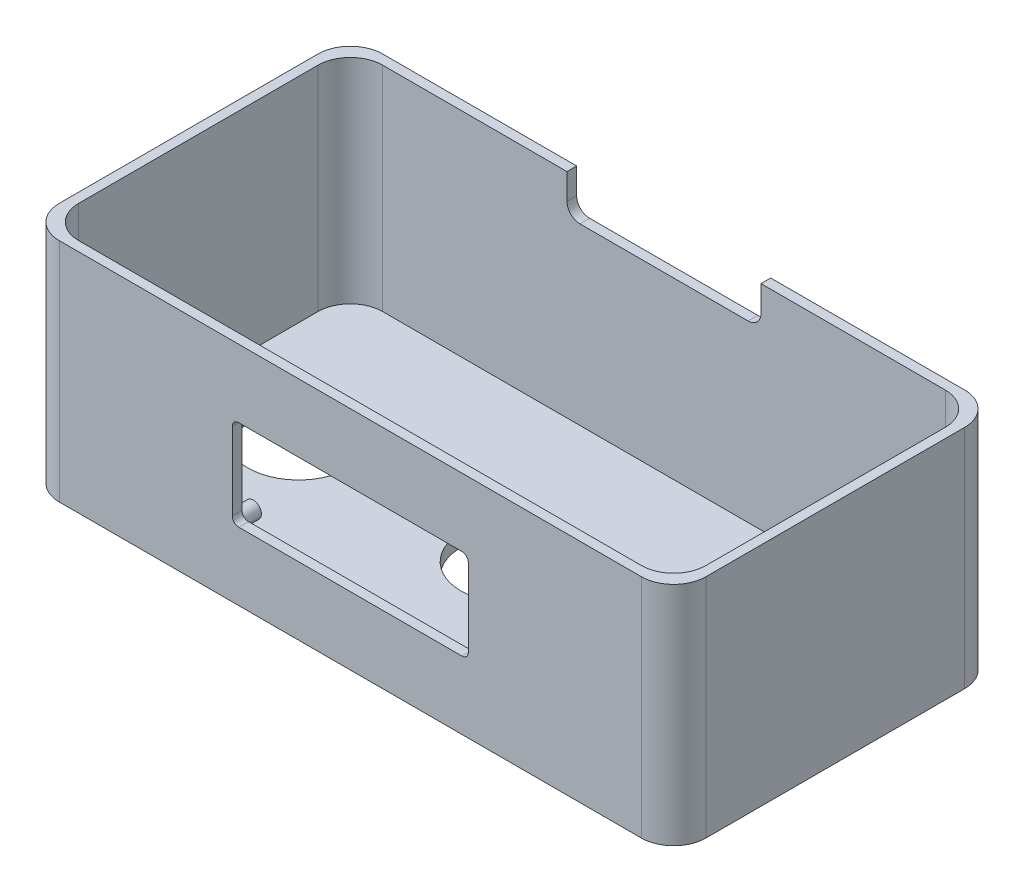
ISO-10303-21;
HEADER;
FILE_DESCRIPTION(('STEP AP214'),'2;1');
FILE_NAME('part.step','',(''),(''),'','','');
FILE_SCHEMA(('AUTOMOTIVE_DESIGN { 1 0 10303 214 1 1 1 1 }'));
ENDSEC;
DATA;
#1=APPLICATION_CONTEXT('core data for automotive mechanical design processes');
#2=APPLICATION_PROTOCOL_DEFINITION('international standard','automotive_design',2000,#1);
#3=PRODUCT_CONTEXT('',#1,'mechanical');
#4=PRODUCT('Part','Part','',(#3));
#5=PRODUCT_RELATED_PRODUCT_CATEGORY('part','',(#4));
#6=PRODUCT_DEFINITION_FORMATION('','',#4);
#7=PRODUCT_DEFINITION_CONTEXT('part definition',#1,'design');
#8=PRODUCT_DEFINITION('design','',#6,#7);
#9=PRODUCT_DEFINITION_SHAPE('','',#8);
#10=(LENGTH_UNIT() NAMED_UNIT(*) SI_UNIT(.MILLI.,.METRE.));
#11=(NAMED_UNIT(*) PLANE_ANGLE_UNIT() SI_UNIT($,.RADIAN.));
#12=(NAMED_UNIT(*) SI_UNIT($,.STERADIAN.) SOLID_ANGLE_UNIT());
#13=UNCERTAINTY_MEASURE_WITH_UNIT(LENGTH_MEASURE(1.E-05),#10,'distance_accuracy_value','');
#14=(GEOMETRIC_REPRESENTATION_CONTEXT(3) GLOBAL_UNCERTAINTY_ASSIGNED_CONTEXT((#13)) GLOBAL_UNIT_ASSIGNED_CONTEXT((#10,
#11,#12)) REPRESENTATION_CONTEXT('',''));
#15=CARTESIAN_POINT('',(0.,0.,0.));
#16=DIRECTION('',(0.,0.,1.));
#17=DIRECTION('',(1.,0.,0.));
#18=AXIS2_PLACEMENT_3D('',#15,#16,#17);
#19=CARTESIAN_POINT('',(100.,70.,50.));
#20=DIRECTION('',(0.,-1.,0.));
#21=DIRECTION('',(0.,0.,-1.));
#22=AXIS2_PLACEMENT_3D('',#19,#20,#21);
#23=CYLINDRICAL_SURFACE('',#22,15.7221428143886);
#24=CARTESIAN_POINT('',(100.,0.,50.));
#25=DIRECTION('',(0.,1.,0.));
#26=DIRECTION('',(0.,0.,1.));
#27=AXIS2_PLACEMENT_3D('',#24,#25,#26);
#28=CIRCLE('',#27,15.7221428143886);
#29=CARTESIAN_POINT('',(100.,0.,65.7221428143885));
#30=VERTEX_POINT('',#29);
#31=EDGE_CURVE('E446',#30,#30,#28,.T.);
#32=ORIENTED_EDGE('',*,*,#31,.F.);
#33=EDGE_LOOP('',(#32));
#34=FACE_BOUND('',#33,.T.);
#35=CARTESIAN_POINT('',(100.,4.,50.));
#36=DIRECTION('',(0.,1.,0.));
#37=DIRECTION('',(0.,0.,1.));
#38=AXIS2_PLACEMENT_3D('',#35,#36,#37);
#39=CIRCLE('',#38,15.7221428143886);
#40=CARTESIAN_POINT('',(100.,4.,65.7221428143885));
#41=VERTEX_POINT('',#40);
#42=EDGE_CURVE('E434',#41,#41,#39,.T.);
#43=ORIENTED_EDGE('',*,*,#42,.T.);
#44=EDGE_LOOP('',(#43));
#45=FACE_BOUND('',#44,.T.);
#46=ADVANCED_FACE('F39',(#34,#45),#23,.F.);
#47=CARTESIAN_POINT('',(166.,70.,50.));
#48=DIRECTION('',(0.,-1.,0.));
#49=DIRECTION('',(0.,0.,-1.));
#50=AXIS2_PLACEMENT_3D('',#47,#48,#49);
#51=CYLINDRICAL_SURFACE('',#50,15.7221428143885);
#52=CARTESIAN_POINT('',(166.,0.,50.));
#53=DIRECTION('',(0.,1.,0.));
#54=DIRECTION('',(0.,0.,1.));
#55=AXIS2_PLACEMENT_3D('',#52,#53,#54);
#56=CIRCLE('',#55,15.7221428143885);
#57=CARTESIAN_POINT('',(166.,0.,65.7221428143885));
#58=VERTEX_POINT('',#57);
#59=EDGE_CURVE('E442',#58,#58,#56,.T.);
#60=ORIENTED_EDGE('',*,*,#59,.F.);
#61=EDGE_LOOP('',(#60));
#62=FACE_BOUND('',#61,.T.);
#63=CARTESIAN_POINT('',(166.,4.,50.));
#64=DIRECTION('',(0.,1.,0.));
#65=DIRECTION('',(0.,0.,1.));
#66=AXIS2_PLACEMENT_3D('',#63,#64,#65);
#67=CIRCLE('',#66,15.7221428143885);
#68=CARTESIAN_POINT('',(166.,4.,65.7221428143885));
#69=VERTEX_POINT('',#68);
#70=EDGE_CURVE('E430',#69,#69,#67,.T.);
#71=ORIENTED_EDGE('',*,*,#70,.T.);
#72=EDGE_LOOP('',(#71));
#73=FACE_BOUND('',#72,.T.);
#74=ADVANCED_FACE('F698',(#62,#73),#51,.F.);
#75=CARTESIAN_POINT('',(34.,70.,50.0000000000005));
#76=DIRECTION('',(0.,-1.,0.));
#77=DIRECTION('',(0.,0.,-1.));
#78=AXIS2_PLACEMENT_3D('',#75,#76,#77);
#79=CYLINDRICAL_SURFACE('',#78,15.7221428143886);
#80=CARTESIAN_POINT('',(34.,0.,50.0000000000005));
#81=DIRECTION('',(0.,1.,0.));
#82=DIRECTION('',(0.,0.,1.));
#83=AXIS2_PLACEMENT_3D('',#80,#81,#82);
#84=CIRCLE('',#83,15.7221428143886);
#85=CARTESIAN_POINT('',(34.,0.,65.722142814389));
#86=VERTEX_POINT('',#85);
#87=EDGE_CURVE('E438',#86,#86,#84,.T.);
#88=ORIENTED_EDGE('',*,*,#87,.F.);
#89=EDGE_LOOP('',(#88));
#90=FACE_BOUND('',#89,.T.);
#91=CARTESIAN_POINT('',(34.,4.,50.0000000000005));
#92=DIRECTION('',(0.,1.,0.));
#93=DIRECTION('',(0.,0.,1.));
#94=AXIS2_PLACEMENT_3D('',#91,#92,#93);
#95=CIRCLE('',#94,15.7221428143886);
#96=CARTESIAN_POINT('',(34.,4.,65.722142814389));
#97=VERTEX_POINT('',#96);
#98=EDGE_CURVE('E407',#97,#97,#95,.T.);
#99=ORIENTED_EDGE('',*,*,#98,.T.);
#100=EDGE_LOOP('',(#99));
#101=FACE_BOUND('',#100,.T.);
#102=ADVANCED_FACE('F704',(#90,#101),#79,.F.);
#103=CARTESIAN_POINT('',(10.,70.,10.));
#104=DIRECTION('',(0.,1.,0.));
#105=DIRECTION('',(0.,0.,1.));
#106=AXIS2_PLACEMENT_3D('',#103,#104,#105);
#107=PLANE('',#106);
#108=DIRECTION('',(0.,0.,-1.));
#109=VECTOR('',#108,1.);
#110=CARTESIAN_POINT('',(130.,70.,66.));
#111=LINE('',#110,#109);
#112=CARTESIAN_POINT('',(130.,70.,3.));
#113=VERTEX_POINT('',#112);
#114=CARTESIAN_POINT('',(130.,70.,0.));
#115=VERTEX_POINT('',#114);
#116=EDGE_CURVE('E321',#113,#115,#111,.T.);
#117=ORIENTED_EDGE('',*,*,#116,.F.);
#118=DIRECTION('',(-1.,0.,0.));
#119=VECTOR('',#118,1.);
#120=CARTESIAN_POINT('',(13.0000000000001,70.,3.));
#121=LINE('',#120,#119);
#122=CARTESIAN_POINT('',(187.,70.,3.));
#123=VERTEX_POINT('',#122);
#124=EDGE_CURVE('E393',#123,#113,#121,.T.);
#125=ORIENTED_EDGE('',*,*,#124,.F.);
#126=CARTESIAN_POINT('',(187.,70.,13.));
#127=DIRECTION('',(0.,1.,0.));
#128=DIRECTION('',(0.,0.,-1.));
#129=AXIS2_PLACEMENT_3D('',#126,#127,#128);
#130=CIRCLE('',#129,10.);
#131=CARTESIAN_POINT('',(197.,70.,13.0000000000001));
#132=VERTEX_POINT('',#131);
#133=EDGE_CURVE('E388',#132,#123,#130,.T.);
#134=ORIENTED_EDGE('',*,*,#133,.F.);
#135=DIRECTION('',(0.,0.,-1.));
#136=VECTOR('',#135,1.);
#137=CARTESIAN_POINT('',(197.,70.,13.0000000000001));
#138=LINE('',#137,#136);
#139=CARTESIAN_POINT('',(197.,70.,87.));
#140=VERTEX_POINT('',#139);
#141=EDGE_CURVE('E384',#140,#132,#138,.T.);
#142=ORIENTED_EDGE('',*,*,#141,.F.);
#143=CARTESIAN_POINT('',(187.,70.,87.));
#144=DIRECTION('',(0.,1.,0.));
#145=DIRECTION('',(0.,0.,1.));
#146=AXIS2_PLACEMENT_3D('',#143,#144,#145);
#147=CIRCLE('',#146,10.);
#148=CARTESIAN_POINT('',(187.,70.,97.));
#149=VERTEX_POINT('',#148);
#150=EDGE_CURVE('E380',#149,#140,#147,.T.);
#151=ORIENTED_EDGE('',*,*,#150,.F.);
#152=DIRECTION('',(1.,0.,0.));
#153=VECTOR('',#152,1.);
#154=CARTESIAN_POINT('',(13.,70.,97.));
#155=LINE('',#154,#153);
#156=CARTESIAN_POINT('',(13.,70.,97.));
#157=VERTEX_POINT('',#156);
#158=EDGE_CURVE('E376',#157,#149,#155,.T.);
#159=ORIENTED_EDGE('',*,*,#158,.F.);
#160=CARTESIAN_POINT('',(13.,70.,87.));
#161=DIRECTION('',(0.,1.,0.));
#162=DIRECTION('',(0.,0.,1.));
#163=AXIS2_PLACEMENT_3D('',#160,#161,#162);
#164=CIRCLE('',#163,9.99999999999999);
#165=CARTESIAN_POINT('',(3.00000000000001,70.,87.));
#166=VERTEX_POINT('',#165);
#167=EDGE_CURVE('E324',#166,#157,#164,.T.);
#168=ORIENTED_EDGE('',*,*,#167,.F.);
#169=DIRECTION('',(0.,0.,1.));
#170=VECTOR('',#169,1.);
#171=CARTESIAN_POINT('',(3.,70.,13.0000000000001));
#172=LINE('',#171,#170);
#173=CARTESIAN_POINT('',(3.,70.,13.0000000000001));
#174=VERTEX_POINT('',#173);
#175=EDGE_CURVE('E345',#174,#166,#172,.T.);
#176=ORIENTED_EDGE('',*,*,#175,.F.);
#177=CARTESIAN_POINT('',(13.,70.,13.));
#178=DIRECTION('',(0.,1.,0.));
#179=DIRECTION('',(0.,0.,1.));
#180=AXIS2_PLACEMENT_3D('',#177,#178,#179);
#181=CIRCLE('',#180,10.);
#182=CARTESIAN_POINT('',(13.0000000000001,70.,3.));
#183=VERTEX_POINT('',#182);
#184=EDGE_CURVE('E397',#183,#174,#181,.T.);
#185=ORIENTED_EDGE('',*,*,#184,.F.);
#186=CARTESIAN_POINT('',(70.0000000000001,70.,3.));
#187=VERTEX_POINT('',#186);
#188=EDGE_CURVE('E392',#187,#183,#121,.T.);
#189=ORIENTED_EDGE('',*,*,#188,.F.);
#190=DIRECTION('',(0.,0.,-1.));
#191=VECTOR('',#190,1.);
#192=CARTESIAN_POINT('',(70.0000000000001,70.,66.));
#193=LINE('',#192,#191);
#194=CARTESIAN_POINT('',(70.0000000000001,70.,0.));
#195=VERTEX_POINT('',#194);
#196=EDGE_CURVE('E325',#187,#195,#193,.T.);
#197=ORIENTED_EDGE('',*,*,#196,.T.);
#198=DIRECTION('',(-1.,0.,0.));
#199=VECTOR('',#198,1.);
#200=CARTESIAN_POINT('',(10.0000000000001,70.,0.));
#201=LINE('',#200,#199);
#202=CARTESIAN_POINT('',(10.0000000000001,70.,0.));
#203=VERTEX_POINT('',#202);
#204=EDGE_CURVE('E474',#195,#203,#201,.T.);
#205=ORIENTED_EDGE('',*,*,#204,.T.);
#206=CARTESIAN_POINT('',(10.,70.,10.));
#207=DIRECTION('',(0.,1.,0.));
#208=DIRECTION('',(0.,0.,1.));
#209=AXIS2_PLACEMENT_3D('',#206,#207,#208);
#210=CIRCLE('',#209,10.);
#211=CARTESIAN_POINT('',(0.,70.,10.0000000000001));
#212=VERTEX_POINT('',#211);
#213=EDGE_CURVE('E451',#203,#212,#210,.T.);
#214=ORIENTED_EDGE('',*,*,#213,.T.);
#215=DIRECTION('',(0.,0.,1.));
#216=VECTOR('',#215,1.);
#217=CARTESIAN_POINT('',(0.,70.,10.0000000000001));
#218=LINE('',#217,#216);
#219=CARTESIAN_POINT('',(0.,70.,90.0000000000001));
#220=VERTEX_POINT('',#219);
#221=EDGE_CURVE('E455',#212,#220,#218,.T.);
#222=ORIENTED_EDGE('',*,*,#221,.T.);
#223=CARTESIAN_POINT('',(10.,70.,90.0000000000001));
#224=DIRECTION('',(0.,1.,0.));
#225=DIRECTION('',(0.,0.,1.));
#226=AXIS2_PLACEMENT_3D('',#223,#224,#225);
#227=CIRCLE('',#226,9.99999999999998);
#228=CARTESIAN_POINT('',(10.,70.,100.));
#229=VERTEX_POINT('',#228);
#230=EDGE_CURVE('E459',#220,#229,#227,.T.);
#231=ORIENTED_EDGE('',*,*,#230,.T.);
#232=DIRECTION('',(1.,0.,0.));
#233=VECTOR('',#232,1.);
#234=CARTESIAN_POINT('',(10.,70.,100.));
#235=LINE('',#234,#233);
#236=CARTESIAN_POINT('',(190.,70.,100.));
#237=VERTEX_POINT('',#236);
#238=EDGE_CURVE('E462',#229,#237,#235,.T.);
#239=ORIENTED_EDGE('',*,*,#238,.T.);
#240=CARTESIAN_POINT('',(190.,70.,90.));
#241=DIRECTION('',(0.,1.,0.));
#242=DIRECTION('',(0.,0.,1.));
#243=AXIS2_PLACEMENT_3D('',#240,#241,#242);
#244=CIRCLE('',#243,10.);
#245=CARTESIAN_POINT('',(200.,70.,90.));
#246=VERTEX_POINT('',#245);
#247=EDGE_CURVE('E465',#237,#246,#244,.T.);
#248=ORIENTED_EDGE('',*,*,#247,.T.);
#249=DIRECTION('',(0.,0.,-1.));
#250=VECTOR('',#249,1.);
#251=CARTESIAN_POINT('',(200.,70.,10.0000000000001));
#252=LINE('',#251,#250);
#253=CARTESIAN_POINT('',(200.,70.,10.0000000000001));
#254=VERTEX_POINT('',#253);
#255=EDGE_CURVE('E468',#246,#254,#252,.T.);
#256=ORIENTED_EDGE('',*,*,#255,.T.);
#257=CARTESIAN_POINT('',(190.,70.,10.));
#258=DIRECTION('',(0.,1.,0.));
#259=DIRECTION('',(0.,0.,-1.));
#260=AXIS2_PLACEMENT_3D('',#257,#258,#259);
#261=CIRCLE('',#260,10.);
#262=CARTESIAN_POINT('',(190.,70.,0.));
#263=VERTEX_POINT('',#262);
#264=EDGE_CURVE('E471',#254,#263,#261,.T.);
#265=ORIENTED_EDGE('',*,*,#264,.T.);
#266=EDGE_CURVE('E475',#263,#115,#201,.T.);
#267=ORIENTED_EDGE('',*,*,#266,.T.);
#268=EDGE_LOOP('',(#117,#125,#134,#142,#151,#159,#168,#176,#185,#189,#197,#205,#214,#222,#231,
#239,#248,#256,#265,#267));
#269=FACE_BOUND('',#268,.T.);
#270=ADVANCED_FACE('F621',(#269),#107,.T.);
#271=CARTESIAN_POINT('',(10.,0.,10.));
#272=DIRECTION('',(0.,1.,0.));
#273=DIRECTION('',(0.,0.,1.));
#274=AXIS2_PLACEMENT_3D('',#271,#272,#273);
#275=PLANE('',#274);
#276=CARTESIAN_POINT('',(10.,0.,10.));
#277=DIRECTION('',(0.,1.,0.));
#278=DIRECTION('',(0.,0.,1.));
#279=AXIS2_PLACEMENT_3D('',#276,#277,#278);
#280=CIRCLE('',#279,10.);
#281=CARTESIAN_POINT('',(10.0000000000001,0.,0.));
#282=VERTEX_POINT('',#281);
#283=CARTESIAN_POINT('',(0.,0.,10.0000000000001));
#284=VERTEX_POINT('',#283);
#285=EDGE_CURVE('E450',#282,#284,#280,.T.);
#286=ORIENTED_EDGE('',*,*,#285,.F.);
#287=DIRECTION('',(-1.,0.,0.));
#288=VECTOR('',#287,1.);
#289=CARTESIAN_POINT('',(10.0000000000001,0.,0.));
#290=LINE('',#289,#288);
#291=CARTESIAN_POINT('',(190.,0.,0.));
#292=VERTEX_POINT('',#291);
#293=EDGE_CURVE('E456',#292,#282,#290,.T.);
#294=ORIENTED_EDGE('',*,*,#293,.F.);
#295=CARTESIAN_POINT('',(190.,0.,10.));
#296=DIRECTION('',(0.,1.,0.));
#297=DIRECTION('',(0.,0.,-1.));
#298=AXIS2_PLACEMENT_3D('',#295,#296,#297);
#299=CIRCLE('',#298,10.);
#300=CARTESIAN_POINT('',(200.,0.,10.0000000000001));
#301=VERTEX_POINT('',#300);
#302=EDGE_CURVE('E498',#301,#292,#299,.T.);
#303=ORIENTED_EDGE('',*,*,#302,.F.);
#304=DIRECTION('',(0.,0.,-1.));
#305=VECTOR('',#304,1.);
#306=CARTESIAN_POINT('',(200.,0.,10.0000000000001));
#307=LINE('',#306,#305);
#308=CARTESIAN_POINT('',(200.,0.,90.));
#309=VERTEX_POINT('',#308);
#310=EDGE_CURVE('E495',#309,#301,#307,.T.);
#311=ORIENTED_EDGE('',*,*,#310,.F.);
#312=CARTESIAN_POINT('',(190.,0.,90.));
#313=DIRECTION('',(0.,1.,0.));
#314=DIRECTION('',(0.,0.,1.));
#315=AXIS2_PLACEMENT_3D('',#312,#313,#314);
#316=CIRCLE('',#315,10.);
#317=CARTESIAN_POINT('',(190.,0.,100.));
#318=VERTEX_POINT('',#317);
#319=EDGE_CURVE('E492',#318,#309,#316,.T.);
#320=ORIENTED_EDGE('',*,*,#319,.F.);
#321=DIRECTION('',(1.,0.,0.));
#322=VECTOR('',#321,1.);
#323=CARTESIAN_POINT('',(10.,0.,100.));
#324=LINE('',#323,#322);
#325=CARTESIAN_POINT('',(10.,0.,100.));
#326=VERTEX_POINT('',#325);
#327=EDGE_CURVE('E489',#326,#318,#324,.T.);
#328=ORIENTED_EDGE('',*,*,#327,.F.);
#329=CARTESIAN_POINT('',(10.,0.,90.0000000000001));
#330=DIRECTION('',(0.,1.,0.));
#331=DIRECTION('',(0.,0.,1.));
#332=AXIS2_PLACEMENT_3D('',#329,#330,#331);
#333=CIRCLE('',#332,9.99999999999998);
#334=CARTESIAN_POINT('',(0.,0.,90.0000000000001));
#335=VERTEX_POINT('',#334);
#336=EDGE_CURVE('E486',#335,#326,#333,.T.);
#337=ORIENTED_EDGE('',*,*,#336,.F.);
#338=DIRECTION('',(0.,0.,1.));
#339=VECTOR('',#338,1.);
#340=CARTESIAN_POINT('',(0.,0.,10.0000000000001));
#341=LINE('',#340,#339);
#342=EDGE_CURVE('E483',#284,#335,#341,.T.);
#343=ORIENTED_EDGE('',*,*,#342,.F.);
#344=EDGE_LOOP('',(#286,#294,#303,#311,#320,#328,#337,#343));
#345=FACE_BOUND('',#344,.T.);
#346=ORIENTED_EDGE('',*,*,#31,.T.);
#347=EDGE_LOOP('',(#346));
#348=FACE_BOUND('',#347,.T.);
#349=ORIENTED_EDGE('',*,*,#59,.T.);
#350=EDGE_LOOP('',(#349));
#351=FACE_BOUND('',#350,.T.);
#352=ORIENTED_EDGE('',*,*,#87,.T.);
#353=EDGE_LOOP('',(#352));
#354=FACE_BOUND('',#353,.T.);
#355=ADVANCED_FACE('F713',(#345,#348,#351,#354),#275,.F.);
#356=CARTESIAN_POINT('',(10.,70.,10.));
#357=DIRECTION('',(0.,-1.,0.));
#358=DIRECTION('',(0.,0.,-1.));
#359=AXIS2_PLACEMENT_3D('',#356,#357,#358);
#360=CYLINDRICAL_SURFACE('',#359,10.);
#361=ORIENTED_EDGE('',*,*,#285,.T.);
#362=DIRECTION('',(0.,-1.,0.));
#363=VECTOR('',#362,1.);
#364=CARTESIAN_POINT('',(0.,70.,10.0000000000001));
#365=LINE('',#364,#363);
#366=EDGE_CURVE('E530',#212,#284,#365,.T.);
#367=ORIENTED_EDGE('',*,*,#366,.F.);
#368=ORIENTED_EDGE('',*,*,#213,.F.);
#369=DIRECTION('',(0.,-1.,0.));
#370=VECTOR('',#369,1.);
#371=CARTESIAN_POINT('',(10.0000000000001,70.,0.));
#372=LINE('',#371,#370);
#373=EDGE_CURVE('E479',#203,#282,#372,.T.);
#374=ORIENTED_EDGE('',*,*,#373,.T.);
#375=EDGE_LOOP('',(#361,#367,#368,#374));
#376=FACE_BOUND('',#375,.T.);
#377=ADVANCED_FACE('F41',(#376),#360,.T.);
#378=CARTESIAN_POINT('',(0.,70.,10.0000000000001));
#379=DIRECTION('',(1.,0.,0.));
#380=DIRECTION('',(0.,0.,-1.));
#381=AXIS2_PLACEMENT_3D('',#378,#379,#380);
#382=PLANE('',#381);
#383=ORIENTED_EDGE('',*,*,#342,.T.);
#384=DIRECTION('',(0.,-1.,0.));
#385=VECTOR('',#384,1.);
#386=CARTESIAN_POINT('',(0.,70.,90.0000000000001));
#387=LINE('',#386,#385);
#388=EDGE_CURVE('E526',#220,#335,#387,.T.);
#389=ORIENTED_EDGE('',*,*,#388,.F.);
#390=ORIENTED_EDGE('',*,*,#221,.F.);
#391=ORIENTED_EDGE('',*,*,#366,.T.);
#392=EDGE_LOOP('',(#383,#389,#390,#391));
#393=FACE_BOUND('',#392,.T.);
#394=ADVANCED_FACE('F655',(#393),#382,.F.);
#395=CARTESIAN_POINT('',(10.,70.,90.0000000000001));
#396=DIRECTION('',(0.,-1.,0.));
#397=DIRECTION('',(0.,0.,-1.));
#398=AXIS2_PLACEMENT_3D('',#395,#396,#397);
#399=CYLINDRICAL_SURFACE('',#398,9.99999999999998);
#400=ORIENTED_EDGE('',*,*,#336,.T.);
#401=DIRECTION('',(0.,-1.,0.));
#402=VECTOR('',#401,1.);
#403=CARTESIAN_POINT('',(10.,70.,100.));
#404=LINE('',#403,#402);
#405=EDGE_CURVE('E522',#229,#326,#404,.T.);
#406=ORIENTED_EDGE('',*,*,#405,.F.);
#407=ORIENTED_EDGE('',*,*,#230,.F.);
#408=ORIENTED_EDGE('',*,*,#388,.T.);
#409=EDGE_LOOP('',(#400,#406,#407,#408));
#410=FACE_BOUND('',#409,.T.);
#411=ADVANCED_FACE('F662',(#410),#399,.T.);
#412=CARTESIAN_POINT('',(10.,70.,100.));
#413=DIRECTION('',(0.,0.,-1.));
#414=DIRECTION('',(-1.,0.,0.));
#415=AXIS2_PLACEMENT_3D('',#412,#413,#414);
#416=PLANE('',#415);
#417=DIRECTION('',(0.,-1.,0.));
#418=VECTOR('',#417,1.);
#419=CARTESIAN_POINT('',(63.5,47.,100.));
#420=LINE('',#419,#418);
#421=CARTESIAN_POINT('',(63.5,47.,100.));
#422=VERTEX_POINT('',#421);
#423=CARTESIAN_POINT('',(63.5,23.,100.));
#424=VERTEX_POINT('',#423);
#425=EDGE_CURVE('E250',#422,#424,#420,.T.);
#426=ORIENTED_EDGE('',*,*,#425,.F.);
#427=CARTESIAN_POINT('',(65.5,47.,100.));
#428=DIRECTION('',(0.,0.,1.));
#429=DIRECTION('',(1.,0.,0.));
#430=AXIS2_PLACEMENT_3D('',#427,#428,#429);
#431=CIRCLE('',#430,2.);
#432=CARTESIAN_POINT('',(65.5,49.,100.));
#433=VERTEX_POINT('',#432);
#434=EDGE_CURVE('E55',#433,#422,#431,.T.);
#435=ORIENTED_EDGE('',*,*,#434,.F.);
#436=DIRECTION('',(-1.,0.,0.));
#437=VECTOR('',#436,1.);
#438=CARTESIAN_POINT('',(65.5,49.,100.));
#439=LINE('',#438,#437);
#440=CARTESIAN_POINT('',(134.5,49.,100.));
#441=VERTEX_POINT('',#440);
#442=EDGE_CURVE('E278',#441,#433,#439,.T.);
#443=ORIENTED_EDGE('',*,*,#442,.F.);
#444=CARTESIAN_POINT('',(134.5,47.,100.));
#445=DIRECTION('',(0.,0.,1.));
#446=DIRECTION('',(-1.,0.,0.));
#447=AXIS2_PLACEMENT_3D('',#444,#445,#446);
#448=CIRCLE('',#447,2.);
#449=CARTESIAN_POINT('',(136.5,47.,100.));
#450=VERTEX_POINT('',#449);
#451=EDGE_CURVE('E274',#450,#441,#448,.T.);
#452=ORIENTED_EDGE('',*,*,#451,.F.);
#453=DIRECTION('',(0.,1.,0.));
#454=VECTOR('',#453,1.);
#455=CARTESIAN_POINT('',(136.5,47.,100.));
#456=LINE('',#455,#454);
#457=CARTESIAN_POINT('',(136.5,23.,100.));
#458=VERTEX_POINT('',#457);
#459=EDGE_CURVE('E270',#458,#450,#456,.T.);
#460=ORIENTED_EDGE('',*,*,#459,.F.);
#461=CARTESIAN_POINT('',(134.5,23.,100.));
#462=DIRECTION('',(0.,0.,1.));
#463=DIRECTION('',(1.,0.,0.));
#464=AXIS2_PLACEMENT_3D('',#461,#462,#463);
#465=CIRCLE('',#464,2.);
#466=CARTESIAN_POINT('',(134.5,21.,100.));
#467=VERTEX_POINT('',#466);
#468=EDGE_CURVE('E263',#467,#458,#465,.T.);
#469=ORIENTED_EDGE('',*,*,#468,.F.);
#470=DIRECTION('',(1.,0.,0.));
#471=VECTOR('',#470,1.);
#472=CARTESIAN_POINT('',(65.5,21.,100.));
#473=LINE('',#472,#471);
#474=CARTESIAN_POINT('',(65.5,21.,100.));
#475=VERTEX_POINT('',#474);
#476=EDGE_CURVE('E259',#475,#467,#473,.T.);
#477=ORIENTED_EDGE('',*,*,#476,.F.);
#478=CARTESIAN_POINT('',(65.5,23.,100.));
#479=DIRECTION('',(0.,0.,1.));
#480=DIRECTION('',(1.,0.,0.));
#481=AXIS2_PLACEMENT_3D('',#478,#479,#480);
#482=CIRCLE('',#481,2.);
#483=EDGE_CURVE('E240',#424,#475,#482,.T.);
#484=ORIENTED_EDGE('',*,*,#483,.F.);
#485=EDGE_LOOP('',(#426,#435,#443,#452,#460,#469,#477,#484));
#486=FACE_BOUND('',#485,.T.);
#487=ORIENTED_EDGE('',*,*,#327,.T.);
#488=DIRECTION('',(0.,-1.,0.));
#489=VECTOR('',#488,1.);
#490=CARTESIAN_POINT('',(190.,70.,100.));
#491=LINE('',#490,#489);
#492=EDGE_CURVE('E518',#237,#318,#491,.T.);
#493=ORIENTED_EDGE('',*,*,#492,.F.);
#494=ORIENTED_EDGE('',*,*,#238,.F.);
#495=ORIENTED_EDGE('',*,*,#405,.T.);
#496=EDGE_LOOP('',(#487,#493,#494,#495));
#497=FACE_BOUND('',#496,.T.);
#498=ADVANCED_FACE('F255',(#486,#497),#416,.F.);
#499=CARTESIAN_POINT('',(190.,70.,90.));
#500=DIRECTION('',(0.,-1.,0.));
#501=DIRECTION('',(0.,0.,-1.));
#502=AXIS2_PLACEMENT_3D('',#499,#500,#501);
#503=CYLINDRICAL_SURFACE('',#502,10.);
#504=ORIENTED_EDGE('',*,*,#319,.T.);
#505=DIRECTION('',(0.,-1.,0.));
#506=VECTOR('',#505,1.);
#507=CARTESIAN_POINT('',(200.,70.,90.));
#508=LINE('',#507,#506);
#509=EDGE_CURVE('E514',#246,#309,#508,.T.);
#510=ORIENTED_EDGE('',*,*,#509,.F.);
#511=ORIENTED_EDGE('',*,*,#247,.F.);
#512=ORIENTED_EDGE('',*,*,#492,.T.);
#513=EDGE_LOOP('',(#504,#510,#511,#512));
#514=FACE_BOUND('',#513,.T.);
#515=ADVANCED_FACE('F669',(#514),#503,.T.);
#516=CARTESIAN_POINT('',(200.,70.,10.0000000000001));
#517=DIRECTION('',(-1.,0.,0.));
#518=DIRECTION('',(0.,0.,1.));
#519=AXIS2_PLACEMENT_3D('',#516,#517,#518);
#520=PLANE('',#519);
#521=ORIENTED_EDGE('',*,*,#310,.T.);
#522=DIRECTION('',(0.,-1.,0.));
#523=VECTOR('',#522,1.);
#524=CARTESIAN_POINT('',(200.,70.,10.0000000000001));
#525=LINE('',#524,#523);
#526=EDGE_CURVE('E510',#254,#301,#525,.T.);
#527=ORIENTED_EDGE('',*,*,#526,.F.);
#528=ORIENTED_EDGE('',*,*,#255,.F.);
#529=ORIENTED_EDGE('',*,*,#509,.T.);
#530=EDGE_LOOP('',(#521,#527,#528,#529));
#531=FACE_BOUND('',#530,.T.);
#532=ADVANCED_FACE('F675',(#531),#520,.F.);
#533=CARTESIAN_POINT('',(190.,70.,10.));
#534=DIRECTION('',(0.,-1.,0.));
#535=DIRECTION('',(0.,0.,-1.));
#536=AXIS2_PLACEMENT_3D('',#533,#534,#535);
#537=CYLINDRICAL_SURFACE('',#536,10.);
#538=ORIENTED_EDGE('',*,*,#302,.T.);
#539=DIRECTION('',(0.,-1.,0.));
#540=VECTOR('',#539,1.);
#541=CARTESIAN_POINT('',(190.,70.,0.));
#542=LINE('',#541,#540);
#543=EDGE_CURVE('E506',#263,#292,#542,.T.);
#544=ORIENTED_EDGE('',*,*,#543,.F.);
#545=ORIENTED_EDGE('',*,*,#264,.F.);
#546=ORIENTED_EDGE('',*,*,#526,.T.);
#547=EDGE_LOOP('',(#538,#544,#545,#546));
#548=FACE_BOUND('',#547,.T.);
#549=ADVANCED_FACE('F679',(#548),#537,.T.);
#550=CARTESIAN_POINT('',(10.0000000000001,70.,0.));
#551=DIRECTION('',(0.,0.,1.));
#552=DIRECTION('',(1.,0.,0.));
#553=AXIS2_PLACEMENT_3D('',#550,#551,#552);
#554=PLANE('',#553);
#555=CARTESIAN_POINT('',(126.,62.,0.));
#556=DIRECTION('',(0.,0.,-1.));
#557=DIRECTION('',(-1.,0.,0.));
#558=AXIS2_PLACEMENT_3D('',#555,#556,#557);
#559=CIRCLE('',#558,4.);
#560=CARTESIAN_POINT('',(130.,62.,0.));
#561=VERTEX_POINT('',#560);
#562=CARTESIAN_POINT('',(126.,58.,0.));
#563=VERTEX_POINT('',#562);
#564=EDGE_CURVE('E305',#561,#563,#559,.T.);
#565=ORIENTED_EDGE('',*,*,#564,.F.);
#566=DIRECTION('',(0.,-1.,0.));
#567=VECTOR('',#566,1.);
#568=CARTESIAN_POINT('',(130.,70.,0.));
#569=LINE('',#568,#567);
#570=EDGE_CURVE('E285',#115,#561,#569,.T.);
#571=ORIENTED_EDGE('',*,*,#570,.F.);
#572=ORIENTED_EDGE('',*,*,#266,.F.);
#573=ORIENTED_EDGE('',*,*,#543,.T.);
#574=ORIENTED_EDGE('',*,*,#293,.T.);
#575=ORIENTED_EDGE('',*,*,#373,.F.);
#576=ORIENTED_EDGE('',*,*,#204,.F.);
#577=DIRECTION('',(0.,1.,0.));
#578=VECTOR('',#577,1.);
#579=CARTESIAN_POINT('',(70.0000000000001,70.,0.));
#580=LINE('',#579,#578);
#581=CARTESIAN_POINT('',(70.,62.0000000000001,0.));
#582=VERTEX_POINT('',#581);
#583=EDGE_CURVE('E317',#582,#195,#580,.T.);
#584=ORIENTED_EDGE('',*,*,#583,.F.);
#585=CARTESIAN_POINT('',(74.,62.,0.));
#586=DIRECTION('',(0.,0.,-1.));
#587=DIRECTION('',(-1.,0.,0.));
#588=AXIS2_PLACEMENT_3D('',#585,#586,#587);
#589=CIRCLE('',#588,3.99999999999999);
#590=CARTESIAN_POINT('',(74.0000000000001,58.,0.));
#591=VERTEX_POINT('',#590);
#592=EDGE_CURVE('E313',#591,#582,#589,.T.);
#593=ORIENTED_EDGE('',*,*,#592,.F.);
#594=DIRECTION('',(-1.,0.,0.));
#595=VECTOR('',#594,1.);
#596=CARTESIAN_POINT('',(126.,58.,0.));
#597=LINE('',#596,#595);
#598=EDGE_CURVE('E309',#563,#591,#597,.T.);
#599=ORIENTED_EDGE('',*,*,#598,.F.);
#600=EDGE_LOOP('',(#565,#571,#572,#573,#574,#575,#576,#584,#593,#599));
#601=FACE_BOUND('',#600,.T.);
#602=ADVANCED_FACE('F650',(#601),#554,.F.);
#603=CARTESIAN_POINT('',(13.,4.,87.));
#604=DIRECTION('',(0.,1.,0.));
#605=DIRECTION('',(0.,0.,1.));
#606=AXIS2_PLACEMENT_3D('',#603,#604,#605);
#607=CYLINDRICAL_SURFACE('',#606,9.99999999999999);
#608=ORIENTED_EDGE('',*,*,#167,.T.);
#609=DIRECTION('',(0.,1.,0.));
#610=VECTOR('',#609,1.);
#611=CARTESIAN_POINT('',(13.,4.,97.));
#612=LINE('',#611,#610);
#613=CARTESIAN_POINT('',(13.,4.,97.));
#614=VERTEX_POINT('',#613);
#615=EDGE_CURVE('E373',#614,#157,#612,.T.);
#616=ORIENTED_EDGE('',*,*,#615,.F.);
#617=CARTESIAN_POINT('',(13.,4.,87.));
#618=DIRECTION('',(0.,1.,0.));
#619=DIRECTION('',(0.,0.,1.));
#620=AXIS2_PLACEMENT_3D('',#617,#618,#619);
#621=CIRCLE('',#620,9.99999999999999);
#622=CARTESIAN_POINT('',(3.00000000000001,4.,87.));
#623=VERTEX_POINT('',#622);
#624=EDGE_CURVE('E340',#623,#614,#621,.T.);
#625=ORIENTED_EDGE('',*,*,#624,.F.);
#626=DIRECTION('',(0.,1.,0.));
#627=VECTOR('',#626,1.);
#628=CARTESIAN_POINT('',(3.00000000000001,4.,87.));
#629=LINE('',#628,#627);
#630=EDGE_CURVE('E404',#623,#166,#629,.T.);
#631=ORIENTED_EDGE('',*,*,#630,.T.);
#632=EDGE_LOOP('',(#608,#616,#625,#631));
#633=FACE_BOUND('',#632,.T.);
#634=ADVANCED_FACE('F629',(#633),#607,.F.);
#635=CARTESIAN_POINT('',(3.,4.,13.0000000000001));
#636=DIRECTION('',(-1.,0.,0.));
#637=DIRECTION('',(0.,0.,1.));
#638=AXIS2_PLACEMENT_3D('',#635,#636,#637);
#639=PLANE('',#638);
#640=ORIENTED_EDGE('',*,*,#175,.T.);
#641=ORIENTED_EDGE('',*,*,#630,.F.);
#642=DIRECTION('',(0.,0.,1.));
#643=VECTOR('',#642,1.);
#644=CARTESIAN_POINT('',(3.,4.,13.0000000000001));
#645=LINE('',#644,#643);
#646=CARTESIAN_POINT('',(3.,4.,13.0000000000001));
#647=VERTEX_POINT('',#646);
#648=EDGE_CURVE('E369',#647,#623,#645,.T.);
#649=ORIENTED_EDGE('',*,*,#648,.F.);
#650=DIRECTION('',(0.,1.,0.));
#651=VECTOR('',#650,1.);
#652=CARTESIAN_POINT('',(3.,4.,13.0000000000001));
#653=LINE('',#652,#651);
#654=EDGE_CURVE('E408',#647,#174,#653,.T.);
#655=ORIENTED_EDGE('',*,*,#654,.T.);
#656=EDGE_LOOP('',(#640,#641,#649,#655));
#657=FACE_BOUND('',#656,.T.);
#658=ADVANCED_FACE('F634',(#657),#639,.F.);
#659=CARTESIAN_POINT('',(13.,4.,13.));
#660=DIRECTION('',(0.,1.,0.));
#661=DIRECTION('',(0.,0.,1.));
#662=AXIS2_PLACEMENT_3D('',#659,#660,#661);
#663=CYLINDRICAL_SURFACE('',#662,10.);
#664=ORIENTED_EDGE('',*,*,#184,.T.);
#665=ORIENTED_EDGE('',*,*,#654,.F.);
#666=CARTESIAN_POINT('',(13.,4.,13.));
#667=DIRECTION('',(0.,1.,0.));
#668=DIRECTION('',(0.,0.,1.));
#669=AXIS2_PLACEMENT_3D('',#666,#667,#668);
#670=CIRCLE('',#669,10.);
#671=CARTESIAN_POINT('',(13.0000000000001,4.,3.));
#672=VERTEX_POINT('',#671);
#673=EDGE_CURVE('E365',#672,#647,#670,.T.);
#674=ORIENTED_EDGE('',*,*,#673,.F.);
#675=DIRECTION('',(0.,1.,0.));
#676=VECTOR('',#675,1.);
#677=CARTESIAN_POINT('',(13.0000000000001,4.,3.));
#678=LINE('',#677,#676);
#679=EDGE_CURVE('E411',#672,#183,#678,.T.);
#680=ORIENTED_EDGE('',*,*,#679,.T.);
#681=EDGE_LOOP('',(#664,#665,#674,#680));
#682=FACE_BOUND('',#681,.T.);
#683=ADVANCED_FACE('F637',(#682),#663,.F.);
#684=CARTESIAN_POINT('',(13.0000000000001,4.,3.));
#685=DIRECTION('',(0.,0.,-1.));
#686=DIRECTION('',(-1.,0.,0.));
#687=AXIS2_PLACEMENT_3D('',#684,#685,#686);
#688=PLANE('',#687);
#689=ORIENTED_EDGE('',*,*,#124,.T.);
#690=DIRECTION('',(0.,-1.,0.));
#691=VECTOR('',#690,1.);
#692=CARTESIAN_POINT('',(130.,4.00000000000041,3.));
#693=LINE('',#692,#691);
#694=CARTESIAN_POINT('',(130.,62.,3.));
#695=VERTEX_POINT('',#694);
#696=EDGE_CURVE('E553',#113,#695,#693,.T.);
#697=ORIENTED_EDGE('',*,*,#696,.T.);
#698=CARTESIAN_POINT('',(126.,62.,3.));
#699=DIRECTION('',(0.,0.,-1.));
#700=DIRECTION('',(-1.,0.,0.));
#701=AXIS2_PLACEMENT_3D('',#698,#699,#700);
#702=CIRCLE('',#701,4.);
#703=CARTESIAN_POINT('',(126.,58.,3.));
#704=VERTEX_POINT('',#703);
#705=EDGE_CURVE('E534',#695,#704,#702,.T.);
#706=ORIENTED_EDGE('',*,*,#705,.T.);
#707=DIRECTION('',(-1.,0.,0.));
#708=VECTOR('',#707,1.);
#709=CARTESIAN_POINT('',(13.0000000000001,58.,3.));
#710=LINE('',#709,#708);
#711=CARTESIAN_POINT('',(74.0000000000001,58.,3.));
#712=VERTEX_POINT('',#711);
#713=EDGE_CURVE('E541',#704,#712,#710,.T.);
#714=ORIENTED_EDGE('',*,*,#713,.T.);
#715=CARTESIAN_POINT('',(74.,62.,3.));
#716=DIRECTION('',(0.,0.,-1.));
#717=DIRECTION('',(-1.,0.,0.));
#718=AXIS2_PLACEMENT_3D('',#715,#716,#717);
#719=CIRCLE('',#718,3.99999999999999);
#720=CARTESIAN_POINT('',(70.,62.0000000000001,3.));
#721=VERTEX_POINT('',#720);
#722=EDGE_CURVE('E545',#712,#721,#719,.T.);
#723=ORIENTED_EDGE('',*,*,#722,.T.);
#724=DIRECTION('',(0.,1.,0.));
#725=VECTOR('',#724,1.);
#726=CARTESIAN_POINT('',(69.9999999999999,3.9999999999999,3.));
#727=LINE('',#726,#725);
#728=EDGE_CURVE('E549',#721,#187,#727,.T.);
#729=ORIENTED_EDGE('',*,*,#728,.T.);
#730=ORIENTED_EDGE('',*,*,#188,.T.);
#731=ORIENTED_EDGE('',*,*,#679,.F.);
#732=DIRECTION('',(-1.,0.,0.));
#733=VECTOR('',#732,1.);
#734=CARTESIAN_POINT('',(13.0000000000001,4.,3.));
#735=LINE('',#734,#733);
#736=CARTESIAN_POINT('',(187.,4.,3.));
#737=VERTEX_POINT('',#736);
#738=EDGE_CURVE('E361',#737,#672,#735,.T.);
#739=ORIENTED_EDGE('',*,*,#738,.F.);
#740=DIRECTION('',(0.,1.,0.));
#741=VECTOR('',#740,1.);
#742=CARTESIAN_POINT('',(187.,4.,3.));
#743=LINE('',#742,#741);
#744=EDGE_CURVE('E415',#737,#123,#743,.T.);
#745=ORIENTED_EDGE('',*,*,#744,.T.);
#746=EDGE_LOOP('',(#689,#697,#706,#714,#723,#729,#730,#731,#739,#745));
#747=FACE_BOUND('',#746,.T.);
#748=ADVANCED_FACE('F640',(#747),#688,.F.);
#749=CARTESIAN_POINT('',(187.,4.,13.));
#750=DIRECTION('',(0.,1.,0.));
#751=DIRECTION('',(0.,0.,1.));
#752=AXIS2_PLACEMENT_3D('',#749,#750,#751);
#753=CYLINDRICAL_SURFACE('',#752,10.);
#754=ORIENTED_EDGE('',*,*,#133,.T.);
#755=ORIENTED_EDGE('',*,*,#744,.F.);
#756=CARTESIAN_POINT('',(187.,4.,13.));
#757=DIRECTION('',(0.,1.,0.));
#758=DIRECTION('',(0.,0.,-1.));
#759=AXIS2_PLACEMENT_3D('',#756,#757,#758);
#760=CIRCLE('',#759,10.);
#761=CARTESIAN_POINT('',(197.,4.,13.0000000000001));
#762=VERTEX_POINT('',#761);
#763=EDGE_CURVE('E357',#762,#737,#760,.T.);
#764=ORIENTED_EDGE('',*,*,#763,.F.);
#765=DIRECTION('',(0.,1.,0.));
#766=VECTOR('',#765,1.);
#767=CARTESIAN_POINT('',(197.,4.,13.0000000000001));
#768=LINE('',#767,#766);
#769=EDGE_CURVE('E418',#762,#132,#768,.T.);
#770=ORIENTED_EDGE('',*,*,#769,.T.);
#771=EDGE_LOOP('',(#754,#755,#764,#770));
#772=FACE_BOUND('',#771,.T.);
#773=ADVANCED_FACE('F686',(#772),#753,.F.);
#774=CARTESIAN_POINT('',(197.,4.,13.0000000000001));
#775=DIRECTION('',(1.,0.,0.));
#776=DIRECTION('',(0.,0.,-1.));
#777=AXIS2_PLACEMENT_3D('',#774,#775,#776);
#778=PLANE('',#777);
#779=ORIENTED_EDGE('',*,*,#141,.T.);
#780=ORIENTED_EDGE('',*,*,#769,.F.);
#781=DIRECTION('',(0.,0.,-1.));
#782=VECTOR('',#781,1.);
#783=CARTESIAN_POINT('',(197.,4.,13.0000000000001));
#784=LINE('',#783,#782);
#785=CARTESIAN_POINT('',(197.,4.,87.));
#786=VERTEX_POINT('',#785);
#787=EDGE_CURVE('E353',#786,#762,#784,.T.);
#788=ORIENTED_EDGE('',*,*,#787,.F.);
#789=DIRECTION('',(0.,1.,0.));
#790=VECTOR('',#789,1.);
#791=CARTESIAN_POINT('',(197.,4.,87.));
#792=LINE('',#791,#790);
#793=EDGE_CURVE('E421',#786,#140,#792,.T.);
#794=ORIENTED_EDGE('',*,*,#793,.T.);
#795=EDGE_LOOP('',(#779,#780,#788,#794));
#796=FACE_BOUND('',#795,.T.);
#797=ADVANCED_FACE('F688',(#796),#778,.F.);
#798=CARTESIAN_POINT('',(187.,4.,87.));
#799=DIRECTION('',(0.,1.,0.));
#800=DIRECTION('',(0.,0.,1.));
#801=AXIS2_PLACEMENT_3D('',#798,#799,#800);
#802=CYLINDRICAL_SURFACE('',#801,10.);
#803=ORIENTED_EDGE('',*,*,#150,.T.);
#804=ORIENTED_EDGE('',*,*,#793,.F.);
#805=CARTESIAN_POINT('',(187.,4.,87.));
#806=DIRECTION('',(0.,1.,0.));
#807=DIRECTION('',(0.,0.,1.));
#808=AXIS2_PLACEMENT_3D('',#805,#806,#807);
#809=CIRCLE('',#808,10.);
#810=CARTESIAN_POINT('',(187.,4.,97.));
#811=VERTEX_POINT('',#810);
#812=EDGE_CURVE('E349',#811,#786,#809,.T.);
#813=ORIENTED_EDGE('',*,*,#812,.F.);
#814=DIRECTION('',(0.,1.,0.));
#815=VECTOR('',#814,1.);
#816=CARTESIAN_POINT('',(187.,4.,97.));
#817=LINE('',#816,#815);
#818=EDGE_CURVE('E424',#811,#149,#817,.T.);
#819=ORIENTED_EDGE('',*,*,#818,.T.);
#820=EDGE_LOOP('',(#803,#804,#813,#819));
#821=FACE_BOUND('',#820,.T.);
#822=ADVANCED_FACE('F603',(#821),#802,.F.);
#823=CARTESIAN_POINT('',(13.,4.,97.));
#824=DIRECTION('',(0.,0.,1.));
#825=DIRECTION('',(1.,0.,0.));
#826=AXIS2_PLACEMENT_3D('',#823,#824,#825);
#827=PLANE('',#826);
#828=CARTESIAN_POINT('',(61.,50.9686269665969,97.));
#829=DIRECTION('',(0.,0.,1.));
#830=DIRECTION('',(1.,0.,0.));
#831=AXIS2_PLACEMENT_3D('',#828,#829,#830);
#832=CIRCLE('',#831,2.5);
#833=CARTESIAN_POINT('',(63.5,50.9686269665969,97.));
#834=VERTEX_POINT('',#833);
#835=EDGE_CURVE('E11',#834,#834,#832,.F.);
#836=ORIENTED_EDGE('',*,*,#835,.F.);
#837=EDGE_LOOP('',(#836));
#838=FACE_BOUND('',#837,.T.);
#839=CARTESIAN_POINT('',(61.,19.0313730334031,97.));
#840=DIRECTION('',(0.,0.,1.));
#841=DIRECTION('',(1.,0.,0.));
#842=AXIS2_PLACEMENT_3D('',#839,#840,#841);
#843=CIRCLE('',#842,2.5);
#844=CARTESIAN_POINT('',(63.5,19.0313730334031,97.));
#845=VERTEX_POINT('',#844);
#846=EDGE_CURVE('E48',#845,#845,#843,.F.);
#847=ORIENTED_EDGE('',*,*,#846,.F.);
#848=EDGE_LOOP('',(#847));
#849=FACE_BOUND('',#848,.T.);
#850=CARTESIAN_POINT('',(139.,19.0313730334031,97.));
#851=DIRECTION('',(0.,0.,1.));
#852=DIRECTION('',(1.,0.,0.));
#853=AXIS2_PLACEMENT_3D('',#850,#851,#852);
#854=CIRCLE('',#853,2.5);
#855=CARTESIAN_POINT('',(141.5,19.0313730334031,97.));
#856=VERTEX_POINT('',#855);
#857=EDGE_CURVE('E590',#856,#856,#854,.F.);
#858=ORIENTED_EDGE('',*,*,#857,.F.);
#859=EDGE_LOOP('',(#858));
#860=FACE_BOUND('',#859,.T.);
#861=CARTESIAN_POINT('',(139.,50.9686269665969,97.));
#862=DIRECTION('',(0.,0.,1.));
#863=DIRECTION('',(1.,0.,0.));
#864=AXIS2_PLACEMENT_3D('',#861,#862,#863);
#865=CIRCLE('',#864,2.5);
#866=CARTESIAN_POINT('',(141.5,50.9686269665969,97.));
#867=VERTEX_POINT('',#866);
#868=EDGE_CURVE('E586',#867,#867,#865,.F.);
#869=ORIENTED_EDGE('',*,*,#868,.F.);
#870=EDGE_LOOP('',(#869));
#871=FACE_BOUND('',#870,.T.);
#872=DIRECTION('',(-1.,0.,0.));
#873=VECTOR('',#872,1.);
#874=CARTESIAN_POINT('',(13.,49.,97.));
#875=LINE('',#874,#873);
#876=CARTESIAN_POINT('',(134.5,49.,97.));
#877=VERTEX_POINT('',#876);
#878=CARTESIAN_POINT('',(65.5,49.,97.));
#879=VERTEX_POINT('',#878);
#880=EDGE_CURVE('E578',#877,#879,#875,.T.);
#881=ORIENTED_EDGE('',*,*,#880,.T.);
#882=CARTESIAN_POINT('',(65.5,47.,97.));
#883=DIRECTION('',(0.,0.,1.));
#884=DIRECTION('',(1.,0.,0.));
#885=AXIS2_PLACEMENT_3D('',#882,#883,#884);
#886=CIRCLE('',#885,2.);
#887=CARTESIAN_POINT('',(63.5,47.,97.));
#888=VERTEX_POINT('',#887);
#889=EDGE_CURVE('E582',#879,#888,#886,.T.);
#890=ORIENTED_EDGE('',*,*,#889,.T.);
#891=DIRECTION('',(0.,-1.,0.));
#892=VECTOR('',#891,1.);
#893=CARTESIAN_POINT('',(63.5,3.99999999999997,97.));
#894=LINE('',#893,#892);
#895=CARTESIAN_POINT('',(63.5,23.,97.));
#896=VERTEX_POINT('',#895);
#897=EDGE_CURVE('E557',#888,#896,#894,.T.);
#898=ORIENTED_EDGE('',*,*,#897,.T.);
#899=CARTESIAN_POINT('',(65.5,23.,97.));
#900=DIRECTION('',(0.,0.,1.));
#901=DIRECTION('',(1.,0.,0.));
#902=AXIS2_PLACEMENT_3D('',#899,#900,#901);
#903=CIRCLE('',#902,2.);
#904=CARTESIAN_POINT('',(65.5,21.,97.));
#905=VERTEX_POINT('',#904);
#906=EDGE_CURVE('E243',#896,#905,#903,.T.);
#907=ORIENTED_EDGE('',*,*,#906,.T.);
#908=DIRECTION('',(1.,0.,0.));
#909=VECTOR('',#908,1.);
#910=CARTESIAN_POINT('',(13.,21.,97.));
#911=LINE('',#910,#909);
#912=CARTESIAN_POINT('',(134.5,21.,97.));
#913=VERTEX_POINT('',#912);
#914=EDGE_CURVE('E562',#905,#913,#911,.T.);
#915=ORIENTED_EDGE('',*,*,#914,.T.);
#916=CARTESIAN_POINT('',(134.5,23.,97.));
#917=DIRECTION('',(0.,0.,1.));
#918=DIRECTION('',(1.,0.,0.));
#919=AXIS2_PLACEMENT_3D('',#916,#917,#918);
#920=CIRCLE('',#919,2.);
#921=CARTESIAN_POINT('',(136.5,23.,97.));
#922=VERTEX_POINT('',#921);
#923=EDGE_CURVE('E566',#913,#922,#920,.T.);
#924=ORIENTED_EDGE('',*,*,#923,.T.);
#925=DIRECTION('',(0.,1.,0.));
#926=VECTOR('',#925,1.);
#927=CARTESIAN_POINT('',(136.5,4.,97.));
#928=LINE('',#927,#926);
#929=CARTESIAN_POINT('',(136.5,47.,97.));
#930=VERTEX_POINT('',#929);
#931=EDGE_CURVE('E570',#922,#930,#928,.T.);
#932=ORIENTED_EDGE('',*,*,#931,.T.);
#933=CARTESIAN_POINT('',(134.5,47.,97.));
#934=DIRECTION('',(0.,0.,1.));
#935=DIRECTION('',(1.,0.,0.));
#936=AXIS2_PLACEMENT_3D('',#933,#934,#935);
#937=CIRCLE('',#936,2.);
#938=EDGE_CURVE('E574',#930,#877,#937,.T.);
#939=ORIENTED_EDGE('',*,*,#938,.T.);
#940=EDGE_LOOP('',(#881,#890,#898,#907,#915,#924,#932,#939));
#941=FACE_BOUND('',#940,.T.);
#942=ORIENTED_EDGE('',*,*,#158,.T.);
#943=ORIENTED_EDGE('',*,*,#818,.F.);
#944=DIRECTION('',(1.,0.,0.));
#945=VECTOR('',#944,1.);
#946=CARTESIAN_POINT('',(13.,4.,97.));
#947=LINE('',#946,#945);
#948=EDGE_CURVE('E344',#614,#811,#947,.T.);
#949=ORIENTED_EDGE('',*,*,#948,.F.);
#950=ORIENTED_EDGE('',*,*,#615,.T.);
#951=EDGE_LOOP('',(#942,#943,#949,#950));
#952=FACE_BOUND('',#951,.T.);
#953=ADVANCED_FACE('F599',(#838,#849,#860,#871,#941,#952),#827,.F.);
#954=CARTESIAN_POINT('',(13.,4.,87.));
#955=DIRECTION('',(0.,1.,0.));
#956=DIRECTION('',(0.,0.,1.));
#957=AXIS2_PLACEMENT_3D('',#954,#955,#956);
#958=PLANE('',#957);
#959=ORIENTED_EDGE('',*,*,#42,.F.);
#960=EDGE_LOOP('',(#959));
#961=FACE_BOUND('',#960,.T.);
#962=ORIENTED_EDGE('',*,*,#70,.F.);
#963=EDGE_LOOP('',(#962));
#964=FACE_BOUND('',#963,.T.);
#965=ORIENTED_EDGE('',*,*,#98,.F.);
#966=EDGE_LOOP('',(#965));
#967=FACE_BOUND('',#966,.T.);
#968=ORIENTED_EDGE('',*,*,#624,.T.);
#969=ORIENTED_EDGE('',*,*,#948,.T.);
#970=ORIENTED_EDGE('',*,*,#812,.T.);
#971=ORIENTED_EDGE('',*,*,#787,.T.);
#972=ORIENTED_EDGE('',*,*,#763,.T.);
#973=ORIENTED_EDGE('',*,*,#738,.T.);
#974=ORIENTED_EDGE('',*,*,#673,.T.);
#975=ORIENTED_EDGE('',*,*,#648,.T.);
#976=EDGE_LOOP('',(#968,#969,#970,#971,#972,#973,#974,#975));
#977=FACE_BOUND('',#976,.T.);
#978=ADVANCED_FACE('F602',(#961,#964,#967,#977),#958,.T.);
#979=CARTESIAN_POINT('',(130.,70.,66.));
#980=DIRECTION('',(1.,0.,0.));
#981=DIRECTION('',(0.,1.,0.));
#982=AXIS2_PLACEMENT_3D('',#979,#980,#981);
#983=PLANE('',#982);
#984=ORIENTED_EDGE('',*,*,#116,.T.);
#985=ORIENTED_EDGE('',*,*,#570,.T.);
#986=DIRECTION('',(0.,0.,-1.));
#987=VECTOR('',#986,1.);
#988=CARTESIAN_POINT('',(130.,62.,66.));
#989=LINE('',#988,#987);
#990=EDGE_CURVE('E320',#695,#561,#989,.T.);
#991=ORIENTED_EDGE('',*,*,#990,.F.);
#992=ORIENTED_EDGE('',*,*,#696,.F.);
#993=EDGE_LOOP('',(#984,#985,#991,#992));
#994=FACE_BOUND('',#993,.T.);
#995=ADVANCED_FACE('F1087',(#994),#983,.F.);
#996=CARTESIAN_POINT('',(70.0000000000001,70.,66.));
#997=DIRECTION('',(-1.,0.,0.));
#998=DIRECTION('',(0.,-1.,0.));
#999=AXIS2_PLACEMENT_3D('',#996,#997,#998);
#1000=PLANE('',#999);
#1001=DIRECTION('',(0.,0.,-1.));
#1002=VECTOR('',#1001,1.);
#1003=CARTESIAN_POINT('',(70.,62.0000000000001,66.));
#1004=LINE('',#1003,#1002);
#1005=EDGE_CURVE('E329',#721,#582,#1004,.T.);
#1006=ORIENTED_EDGE('',*,*,#1005,.T.);
#1007=ORIENTED_EDGE('',*,*,#583,.T.);
#1008=ORIENTED_EDGE('',*,*,#196,.F.);
#1009=ORIENTED_EDGE('',*,*,#728,.F.);
#1010=EDGE_LOOP('',(#1006,#1007,#1008,#1009));
#1011=FACE_BOUND('',#1010,.T.);
#1012=ADVANCED_FACE('F1096',(#1011),#1000,.F.);
#1013=CARTESIAN_POINT('',(74.,62.,66.));
#1014=DIRECTION('',(0.,0.,-1.));
#1015=DIRECTION('',(-1.,0.,0.));
#1016=AXIS2_PLACEMENT_3D('',#1013,#1014,#1015);
#1017=CYLINDRICAL_SURFACE('',#1016,3.99999999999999);
#1018=DIRECTION('',(0.,0.,-1.));
#1019=VECTOR('',#1018,1.);
#1020=CARTESIAN_POINT('',(74.0000000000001,58.,66.));
#1021=LINE('',#1020,#1019);
#1022=EDGE_CURVE('E332',#712,#591,#1021,.T.);
#1023=ORIENTED_EDGE('',*,*,#1022,.T.);
#1024=ORIENTED_EDGE('',*,*,#592,.T.);
#1025=ORIENTED_EDGE('',*,*,#1005,.F.);
#1026=ORIENTED_EDGE('',*,*,#722,.F.);
#1027=EDGE_LOOP('',(#1023,#1024,#1025,#1026));
#1028=FACE_BOUND('',#1027,.T.);
#1029=ADVANCED_FACE('F1101',(#1028),#1017,.F.);
#1030=CARTESIAN_POINT('',(126.,58.,66.));
#1031=DIRECTION('',(0.,-1.,0.));
#1032=DIRECTION('',(1.,0.,0.));
#1033=AXIS2_PLACEMENT_3D('',#1030,#1031,#1032);
#1034=PLANE('',#1033);
#1035=DIRECTION('',(0.,0.,-1.));
#1036=VECTOR('',#1035,1.);
#1037=CARTESIAN_POINT('',(126.,58.,66.));
#1038=LINE('',#1037,#1036);
#1039=EDGE_CURVE('E335',#704,#563,#1038,.T.);
#1040=ORIENTED_EDGE('',*,*,#1039,.T.);
#1041=ORIENTED_EDGE('',*,*,#598,.T.);
#1042=ORIENTED_EDGE('',*,*,#1022,.F.);
#1043=ORIENTED_EDGE('',*,*,#713,.F.);
#1044=EDGE_LOOP('',(#1040,#1041,#1042,#1043));
#1045=FACE_BOUND('',#1044,.T.);
#1046=ADVANCED_FACE('F1109',(#1045),#1034,.F.);
#1047=CARTESIAN_POINT('',(126.,62.,66.));
#1048=DIRECTION('',(0.,0.,-1.));
#1049=DIRECTION('',(-1.,0.,0.));
#1050=AXIS2_PLACEMENT_3D('',#1047,#1048,#1049);
#1051=CYLINDRICAL_SURFACE('',#1050,4.);
#1052=ORIENTED_EDGE('',*,*,#990,.T.);
#1053=ORIENTED_EDGE('',*,*,#564,.T.);
#1054=ORIENTED_EDGE('',*,*,#1039,.F.);
#1055=ORIENTED_EDGE('',*,*,#705,.F.);
#1056=EDGE_LOOP('',(#1052,#1053,#1054,#1055));
#1057=FACE_BOUND('',#1056,.T.);
#1058=ADVANCED_FACE('F807',(#1057),#1051,.F.);
#1059=CARTESIAN_POINT('',(65.5,47.,90.));
#1060=DIRECTION('',(0.,0.,1.));
#1061=DIRECTION('',(1.,0.,0.));
#1062=AXIS2_PLACEMENT_3D('',#1059,#1060,#1061);
#1063=CYLINDRICAL_SURFACE('',#1062,2.);
#1064=DIRECTION('',(0.,0.,1.));
#1065=VECTOR('',#1064,1.);
#1066=CARTESIAN_POINT('',(65.5,49.,90.));
#1067=LINE('',#1066,#1065);
#1068=EDGE_CURVE('E282',#879,#433,#1067,.T.);
#1069=ORIENTED_EDGE('',*,*,#1068,.T.);
#1070=ORIENTED_EDGE('',*,*,#434,.T.);
#1071=DIRECTION('',(0.,0.,1.));
#1072=VECTOR('',#1071,1.);
#1073=CARTESIAN_POINT('',(63.5,47.,90.));
#1074=LINE('',#1073,#1072);
#1075=EDGE_CURVE('E247',#888,#422,#1074,.T.);
#1076=ORIENTED_EDGE('',*,*,#1075,.F.);
#1077=ORIENTED_EDGE('',*,*,#889,.F.);
#1078=EDGE_LOOP('',(#1069,#1070,#1076,#1077));
#1079=FACE_BOUND('',#1078,.T.);
#1080=ADVANCED_FACE('F812',(#1079),#1063,.F.);
#1081=CARTESIAN_POINT('',(65.5,49.,90.));
#1082=DIRECTION('',(0.,1.,0.));
#1083=DIRECTION('',(-1.,0.,0.));
#1084=AXIS2_PLACEMENT_3D('',#1081,#1082,#1083);
#1085=PLANE('',#1084);
#1086=DIRECTION('',(0.,0.,1.));
#1087=VECTOR('',#1086,1.);
#1088=CARTESIAN_POINT('',(134.5,49.,90.));
#1089=LINE('',#1088,#1087);
#1090=EDGE_CURVE('E286',#877,#441,#1089,.T.);
#1091=ORIENTED_EDGE('',*,*,#1090,.T.);
#1092=ORIENTED_EDGE('',*,*,#442,.T.);
#1093=ORIENTED_EDGE('',*,*,#1068,.F.);
#1094=ORIENTED_EDGE('',*,*,#880,.F.);
#1095=EDGE_LOOP('',(#1091,#1092,#1093,#1094));
#1096=FACE_BOUND('',#1095,.T.);
#1097=ADVANCED_FACE('F817',(#1096),#1085,.F.);
#1098=CARTESIAN_POINT('',(134.5,47.,90.));
#1099=DIRECTION('',(0.,0.,1.));
#1100=DIRECTION('',(1.,0.,0.));
#1101=AXIS2_PLACEMENT_3D('',#1098,#1099,#1100);
#1102=CYLINDRICAL_SURFACE('',#1101,2.);
#1103=DIRECTION('',(0.,0.,1.));
#1104=VECTOR('',#1103,1.);
#1105=CARTESIAN_POINT('',(136.5,47.,90.));
#1106=LINE('',#1105,#1104);
#1107=EDGE_CURVE('E289',#930,#450,#1106,.T.);
#1108=ORIENTED_EDGE('',*,*,#1107,.T.);
#1109=ORIENTED_EDGE('',*,*,#451,.T.);
#1110=ORIENTED_EDGE('',*,*,#1090,.F.);
#1111=ORIENTED_EDGE('',*,*,#938,.F.);
#1112=EDGE_LOOP('',(#1108,#1109,#1110,#1111));
#1113=FACE_BOUND('',#1112,.T.);
#1114=ADVANCED_FACE('F826',(#1113),#1102,.F.);
#1115=CARTESIAN_POINT('',(136.5,47.,90.));
#1116=DIRECTION('',(1.,0.,0.));
#1117=DIRECTION('',(0.,0.,-1.));
#1118=AXIS2_PLACEMENT_3D('',#1115,#1116,#1117);
#1119=PLANE('',#1118);
#1120=DIRECTION('',(0.,0.,1.));
#1121=VECTOR('',#1120,1.);
#1122=CARTESIAN_POINT('',(136.5,23.,90.));
#1123=LINE('',#1122,#1121);
#1124=EDGE_CURVE('E292',#922,#458,#1123,.T.);
#1125=ORIENTED_EDGE('',*,*,#1124,.T.);
#1126=ORIENTED_EDGE('',*,*,#459,.T.);
#1127=ORIENTED_EDGE('',*,*,#1107,.F.);
#1128=ORIENTED_EDGE('',*,*,#931,.F.);
#1129=EDGE_LOOP('',(#1125,#1126,#1127,#1128));
#1130=FACE_BOUND('',#1129,.T.);
#1131=ADVANCED_FACE('F836',(#1130),#1119,.F.);
#1132=CARTESIAN_POINT('',(134.5,23.,90.));
#1133=DIRECTION('',(0.,0.,1.));
#1134=DIRECTION('',(1.,0.,0.));
#1135=AXIS2_PLACEMENT_3D('',#1132,#1133,#1134);
#1136=CYLINDRICAL_SURFACE('',#1135,2.);
#1137=DIRECTION('',(0.,0.,1.));
#1138=VECTOR('',#1137,1.);
#1139=CARTESIAN_POINT('',(134.5,21.,90.));
#1140=LINE('',#1139,#1138);
#1141=EDGE_CURVE('E295',#913,#467,#1140,.T.);
#1142=ORIENTED_EDGE('',*,*,#1141,.T.);
#1143=ORIENTED_EDGE('',*,*,#468,.T.);
#1144=ORIENTED_EDGE('',*,*,#1124,.F.);
#1145=ORIENTED_EDGE('',*,*,#923,.F.);
#1146=EDGE_LOOP('',(#1142,#1143,#1144,#1145));
#1147=FACE_BOUND('',#1146,.T.);
#1148=ADVANCED_FACE('F846',(#1147),#1136,.F.);
#1149=CARTESIAN_POINT('',(65.5,21.,90.));
#1150=DIRECTION('',(0.,-1.,0.));
#1151=DIRECTION('',(1.,0.,0.));
#1152=AXIS2_PLACEMENT_3D('',#1149,#1150,#1151);
#1153=PLANE('',#1152);
#1154=DIRECTION('',(0.,0.,1.));
#1155=VECTOR('',#1154,1.);
#1156=CARTESIAN_POINT('',(65.5,21.,90.));
#1157=LINE('',#1156,#1155);
#1158=EDGE_CURVE('E246',#905,#475,#1157,.T.);
#1159=ORIENTED_EDGE('',*,*,#1158,.T.);
#1160=ORIENTED_EDGE('',*,*,#476,.T.);
#1161=ORIENTED_EDGE('',*,*,#1141,.F.);
#1162=ORIENTED_EDGE('',*,*,#914,.F.);
#1163=EDGE_LOOP('',(#1159,#1160,#1161,#1162));
#1164=FACE_BOUND('',#1163,.T.);
#1165=ADVANCED_FACE('F856',(#1164),#1153,.F.);
#1166=CARTESIAN_POINT('',(65.5,23.,90.));
#1167=DIRECTION('',(0.,0.,1.));
#1168=DIRECTION('',(1.,0.,0.));
#1169=AXIS2_PLACEMENT_3D('',#1166,#1167,#1168);
#1170=CYLINDRICAL_SURFACE('',#1169,2.);
#1171=DIRECTION('',(0.,0.,1.));
#1172=VECTOR('',#1171,1.);
#1173=CARTESIAN_POINT('',(63.5,23.,90.));
#1174=LINE('',#1173,#1172);
#1175=EDGE_CURVE('E63',#896,#424,#1174,.T.);
#1176=ORIENTED_EDGE('',*,*,#1175,.T.);
#1177=ORIENTED_EDGE('',*,*,#483,.T.);
#1178=ORIENTED_EDGE('',*,*,#1158,.F.);
#1179=ORIENTED_EDGE('',*,*,#906,.F.);
#1180=EDGE_LOOP('',(#1176,#1177,#1178,#1179));
#1181=FACE_BOUND('',#1180,.T.);
#1182=ADVANCED_FACE('F237',(#1181),#1170,.F.);
#1183=CARTESIAN_POINT('',(63.5,47.,90.));
#1184=DIRECTION('',(-1.,0.,0.));
#1185=DIRECTION('',(0.,-1.,0.));
#1186=AXIS2_PLACEMENT_3D('',#1183,#1184,#1185);
#1187=PLANE('',#1186);
#1188=ORIENTED_EDGE('',*,*,#1075,.T.);
#1189=ORIENTED_EDGE('',*,*,#425,.T.);
#1190=ORIENTED_EDGE('',*,*,#1175,.F.);
#1191=ORIENTED_EDGE('',*,*,#897,.F.);
#1192=EDGE_LOOP('',(#1188,#1189,#1190,#1191));
#1193=FACE_BOUND('',#1192,.T.);
#1194=ADVANCED_FACE('F251',(#1193),#1187,.F.);
#1195=CARTESIAN_POINT('',(139.,50.9686269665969,91.));
#1196=DIRECTION('',(0.,0.,-1.));
#1197=DIRECTION('',(-1.,0.,0.));
#1198=AXIS2_PLACEMENT_3D('',#1195,#1196,#1197);
#1199=PLANE('',#1198);
#1200=CARTESIAN_POINT('',(139.,50.9686269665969,91.));
#1201=DIRECTION('',(0.,0.,-1.));
#1202=DIRECTION('',(-1.,0.,0.));
#1203=AXIS2_PLACEMENT_3D('',#1200,#1201,#1202);
#1204=CIRCLE('',#1203,2.5);
#1205=CARTESIAN_POINT('',(136.5,50.9686269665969,91.));
#1206=VERTEX_POINT('',#1205);
#1207=EDGE_CURVE('E1205',#1206,#1206,#1204,.T.);
#1208=ORIENTED_EDGE('',*,*,#1207,.T.);
#1209=EDGE_LOOP('',(#1208));
#1210=FACE_BOUND('',#1209,.T.);
#1211=CARTESIAN_POINT('',(139.,50.9686269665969,91.));
#1212=DIRECTION('',(0.,0.,-1.));
#1213=DIRECTION('',(-1.,0.,0.));
#1214=AXIS2_PLACEMENT_3D('',#1211,#1212,#1213);
#1215=CIRCLE('',#1214,1.5);
#1216=CARTESIAN_POINT('',(137.5,50.9686269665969,91.));
#1217=VERTEX_POINT('',#1216);
#1218=EDGE_CURVE('E1201',#1217,#1217,#1215,.T.);
#1219=ORIENTED_EDGE('',*,*,#1218,.F.);
#1220=EDGE_LOOP('',(#1219));
#1221=FACE_BOUND('',#1220,.T.);
#1222=ADVANCED_FACE('F883',(#1210,#1221),#1199,.T.);
#1223=CARTESIAN_POINT('',(139.,50.9686269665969,91.));
#1224=DIRECTION('',(0.,0.,1.));
#1225=DIRECTION('',(1.,0.,0.));
#1226=AXIS2_PLACEMENT_3D('',#1223,#1224,#1225);
#1227=CYLINDRICAL_SURFACE('',#1226,2.5);
#1228=ORIENTED_EDGE('',*,*,#1207,.F.);
#1229=EDGE_LOOP('',(#1228));
#1230=FACE_BOUND('',#1229,.T.);
#1231=ORIENTED_EDGE('',*,*,#868,.T.);
#1232=EDGE_LOOP('',(#1231));
#1233=FACE_BOUND('',#1232,.T.);
#1234=ADVANCED_FACE('F902',(#1230,#1233),#1227,.T.);
#1235=CARTESIAN_POINT('',(139.,50.9686269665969,91.));
#1236=DIRECTION('',(0.,0.,1.));
#1237=DIRECTION('',(1.,0.,0.));
#1238=AXIS2_PLACEMENT_3D('',#1235,#1236,#1237);
#1239=CYLINDRICAL_SURFACE('',#1238,1.5);
#1240=ORIENTED_EDGE('',*,*,#1218,.T.);
#1241=EDGE_LOOP('',(#1240));
#1242=FACE_BOUND('',#1241,.T.);
#1243=CARTESIAN_POINT('',(139.,50.9686269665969,97.));
#1244=DIRECTION('',(0.,0.,-1.));
#1245=DIRECTION('',(-1.,0.,0.));
#1246=AXIS2_PLACEMENT_3D('',#1243,#1244,#1245);
#1247=CIRCLE('',#1246,1.5);
#1248=CARTESIAN_POINT('',(137.5,50.9686269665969,97.));
#1249=VERTEX_POINT('',#1248);
#1250=EDGE_CURVE('E1200',#1249,#1249,#1247,.T.);
#1251=ORIENTED_EDGE('',*,*,#1250,.F.);
#1252=EDGE_LOOP('',(#1251));
#1253=FACE_BOUND('',#1252,.T.);
#1254=ADVANCED_FACE('F913',(#1242,#1253),#1239,.F.);
#1255=ORIENTED_EDGE('',*,*,#1250,.T.);
#1256=EDGE_LOOP('',(#1255));
#1257=FACE_BOUND('',#1256,.T.);
#1258=ADVANCED_FACE('F607',(#1257),#827,.F.);
#1259=CARTESIAN_POINT('',(139.,19.0313730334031,91.));
#1260=DIRECTION('',(0.,0.,1.));
#1261=DIRECTION('',(1.,0.,0.));
#1262=AXIS2_PLACEMENT_3D('',#1259,#1260,#1261);
#1263=PLANE('',#1262);
#1264=CARTESIAN_POINT('',(139.,19.0313730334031,91.));
#1265=DIRECTION('',(0.,0.,-1.));
#1266=DIRECTION('',(1.,0.,0.));
#1267=AXIS2_PLACEMENT_3D('',#1264,#1265,#1266);
#1268=CIRCLE('',#1267,2.5);
#1269=CARTESIAN_POINT('',(141.5,19.0313730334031,91.));
#1270=VERTEX_POINT('',#1269);
#1271=EDGE_CURVE('E1193',#1270,#1270,#1268,.T.);
#1272=ORIENTED_EDGE('',*,*,#1271,.T.);
#1273=EDGE_LOOP('',(#1272));
#1274=FACE_BOUND('',#1273,.T.);
#1275=CARTESIAN_POINT('',(139.,19.0313730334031,91.));
#1276=DIRECTION('',(0.,0.,-1.));
#1277=DIRECTION('',(1.,0.,0.));
#1278=AXIS2_PLACEMENT_3D('',#1275,#1276,#1277);
#1279=CIRCLE('',#1278,1.5);
#1280=CARTESIAN_POINT('',(140.5,19.0313730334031,91.));
#1281=VERTEX_POINT('',#1280);
#1282=EDGE_CURVE('E1189',#1281,#1281,#1279,.T.);
#1283=ORIENTED_EDGE('',*,*,#1282,.F.);
#1284=EDGE_LOOP('',(#1283));
#1285=FACE_BOUND('',#1284,.T.);
#1286=ADVANCED_FACE('F932',(#1274,#1285),#1263,.F.);
#1287=CARTESIAN_POINT('',(139.,19.0313730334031,91.));
#1288=DIRECTION('',(0.,0.,1.));
#1289=DIRECTION('',(1.,0.,0.));
#1290=AXIS2_PLACEMENT_3D('',#1287,#1288,#1289);
#1291=CYLINDRICAL_SURFACE('',#1290,2.5);
#1292=ORIENTED_EDGE('',*,*,#1271,.F.);
#1293=EDGE_LOOP('',(#1292));
#1294=FACE_BOUND('',#1293,.T.);
#1295=ORIENTED_EDGE('',*,*,#857,.T.);
#1296=EDGE_LOOP('',(#1295));
#1297=FACE_BOUND('',#1296,.T.);
#1298=ADVANCED_FACE('F942',(#1294,#1297),#1291,.T.);
#1299=CARTESIAN_POINT('',(139.,19.0313730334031,91.));
#1300=DIRECTION('',(0.,0.,1.));
#1301=DIRECTION('',(1.,0.,0.));
#1302=AXIS2_PLACEMENT_3D('',#1299,#1300,#1301);
#1303=CYLINDRICAL_SURFACE('',#1302,1.5);
#1304=ORIENTED_EDGE('',*,*,#1282,.T.);
#1305=EDGE_LOOP('',(#1304));
#1306=FACE_BOUND('',#1305,.T.);
#1307=CARTESIAN_POINT('',(139.,19.0313730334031,97.));
#1308=DIRECTION('',(0.,0.,-1.));
#1309=DIRECTION('',(1.,0.,0.));
#1310=AXIS2_PLACEMENT_3D('',#1307,#1308,#1309);
#1311=CIRCLE('',#1310,1.5);
#1312=CARTESIAN_POINT('',(140.5,19.0313730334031,97.));
#1313=VERTEX_POINT('',#1312);
#1314=EDGE_CURVE('E1188',#1313,#1313,#1311,.T.);
#1315=ORIENTED_EDGE('',*,*,#1314,.F.);
#1316=EDGE_LOOP('',(#1315));
#1317=FACE_BOUND('',#1316,.T.);
#1318=ADVANCED_FACE('F952',(#1306,#1317),#1303,.F.);
#1319=ORIENTED_EDGE('',*,*,#1314,.T.);
#1320=EDGE_LOOP('',(#1319));
#1321=FACE_BOUND('',#1320,.T.);
#1322=ADVANCED_FACE('F934',(#1321),#827,.F.);
#1323=CARTESIAN_POINT('',(61.,19.0313730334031,91.));
#1324=DIRECTION('',(0.,0.,-1.));
#1325=DIRECTION('',(-1.,0.,0.));
#1326=AXIS2_PLACEMENT_3D('',#1323,#1324,#1325);
#1327=PLANE('',#1326);
#1328=CARTESIAN_POINT('',(61.,19.0313730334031,91.));
#1329=DIRECTION('',(0.,0.,-1.));
#1330=DIRECTION('',(-1.,0.,0.));
#1331=AXIS2_PLACEMENT_3D('',#1328,#1329,#1330);
#1332=CIRCLE('',#1331,2.5);
#1333=CARTESIAN_POINT('',(58.5,19.0313730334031,91.));
#1334=VERTEX_POINT('',#1333);
#1335=EDGE_CURVE('E1181',#1334,#1334,#1332,.T.);
#1336=ORIENTED_EDGE('',*,*,#1335,.T.);
#1337=EDGE_LOOP('',(#1336));
#1338=FACE_BOUND('',#1337,.T.);
#1339=CARTESIAN_POINT('',(61.,19.0313730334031,91.));
#1340=DIRECTION('',(0.,0.,-1.));
#1341=DIRECTION('',(-1.,0.,0.));
#1342=AXIS2_PLACEMENT_3D('',#1339,#1340,#1341);
#1343=CIRCLE('',#1342,1.5);
#1344=CARTESIAN_POINT('',(59.5,19.0313730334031,91.));
#1345=VERTEX_POINT('',#1344);
#1346=EDGE_CURVE('E1177',#1345,#1345,#1343,.T.);
#1347=ORIENTED_EDGE('',*,*,#1346,.F.);
#1348=EDGE_LOOP('',(#1347));
#1349=FACE_BOUND('',#1348,.T.);
#1350=ADVANCED_FACE('F971',(#1338,#1349),#1327,.T.);
#1351=CARTESIAN_POINT('',(61.,19.0313730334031,91.));
#1352=DIRECTION('',(0.,0.,1.));
#1353=DIRECTION('',(1.,0.,0.));
#1354=AXIS2_PLACEMENT_3D('',#1351,#1352,#1353);
#1355=CYLINDRICAL_SURFACE('',#1354,2.5);
#1356=ORIENTED_EDGE('',*,*,#1335,.F.);
#1357=EDGE_LOOP('',(#1356));
#1358=FACE_BOUND('',#1357,.T.);
#1359=ORIENTED_EDGE('',*,*,#846,.T.);
#1360=EDGE_LOOP('',(#1359));
#1361=FACE_BOUND('',#1360,.T.);
#1362=ADVANCED_FACE('F597',(#1358,#1361),#1355,.T.);
#1363=CARTESIAN_POINT('',(61.,19.0313730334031,91.));
#1364=DIRECTION('',(0.,0.,1.));
#1365=DIRECTION('',(1.,0.,0.));
#1366=AXIS2_PLACEMENT_3D('',#1363,#1364,#1365);
#1367=CYLINDRICAL_SURFACE('',#1366,1.5);
#1368=ORIENTED_EDGE('',*,*,#1346,.T.);
#1369=EDGE_LOOP('',(#1368));
#1370=FACE_BOUND('',#1369,.T.);
#1371=CARTESIAN_POINT('',(61.,19.0313730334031,97.));
#1372=DIRECTION('',(0.,0.,-1.));
#1373=DIRECTION('',(-1.,0.,0.));
#1374=AXIS2_PLACEMENT_3D('',#1371,#1372,#1373);
#1375=CIRCLE('',#1374,1.5);
#1376=CARTESIAN_POINT('',(59.5,19.0313730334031,97.));
#1377=VERTEX_POINT('',#1376);
#1378=EDGE_CURVE('E1176',#1377,#1377,#1375,.T.);
#1379=ORIENTED_EDGE('',*,*,#1378,.F.);
#1380=EDGE_LOOP('',(#1379));
#1381=FACE_BOUND('',#1380,.T.);
#1382=ADVANCED_FACE('F990',(#1370,#1381),#1367,.F.);
#1383=ORIENTED_EDGE('',*,*,#1378,.T.);
#1384=EDGE_LOOP('',(#1383));
#1385=FACE_BOUND('',#1384,.T.);
#1386=ADVANCED_FACE('F973',(#1385),#827,.F.);
#1387=CARTESIAN_POINT('',(61.,50.9686269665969,91.));
#1388=DIRECTION('',(0.,0.,1.));
#1389=DIRECTION('',(1.,0.,0.));
#1390=AXIS2_PLACEMENT_3D('',#1387,#1388,#1389);
#1391=PLANE('',#1390);
#1392=CARTESIAN_POINT('',(61.,50.9686269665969,91.));
#1393=DIRECTION('',(0.,0.,-1.));
#1394=DIRECTION('',(1.,0.,0.));
#1395=AXIS2_PLACEMENT_3D('',#1392,#1393,#1394);
#1396=CIRCLE('',#1395,2.5);
#1397=CARTESIAN_POINT('',(63.5,50.9686269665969,91.));
#1398=VERTEX_POINT('',#1397);
#1399=EDGE_CURVE('E1170',#1398,#1398,#1396,.T.);
#1400=ORIENTED_EDGE('',*,*,#1399,.T.);
#1401=EDGE_LOOP('',(#1400));
#1402=FACE_BOUND('',#1401,.T.);
#1403=CARTESIAN_POINT('',(61.,50.9686269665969,91.));
#1404=DIRECTION('',(0.,0.,-1.));
#1405=DIRECTION('',(1.,0.,0.));
#1406=AXIS2_PLACEMENT_3D('',#1403,#1404,#1405);
#1407=CIRCLE('',#1406,1.5);
#1408=CARTESIAN_POINT('',(62.5,50.9686269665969,91.));
#1409=VERTEX_POINT('',#1408);
#1410=EDGE_CURVE('E1166',#1409,#1409,#1407,.T.);
#1411=ORIENTED_EDGE('',*,*,#1410,.F.);
#1412=EDGE_LOOP('',(#1411));
#1413=FACE_BOUND('',#1412,.T.);
#1414=ADVANCED_FACE('F1009',(#1402,#1413),#1391,.F.);
#1415=CARTESIAN_POINT('',(61.,50.9686269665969,91.));
#1416=DIRECTION('',(0.,0.,1.));
#1417=DIRECTION('',(1.,0.,0.));
#1418=AXIS2_PLACEMENT_3D('',#1415,#1416,#1417);
#1419=CYLINDRICAL_SURFACE('',#1418,2.5);
#1420=ORIENTED_EDGE('',*,*,#1399,.F.);
#1421=EDGE_LOOP('',(#1420));
#1422=FACE_BOUND('',#1421,.T.);
#1423=ORIENTED_EDGE('',*,*,#835,.T.);
#1424=EDGE_LOOP('',(#1423));
#1425=FACE_BOUND('',#1424,.T.);
#1426=ADVANCED_FACE('F1017',(#1422,#1425),#1419,.T.);
#1427=CARTESIAN_POINT('',(61.,50.9686269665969,91.));
#1428=DIRECTION('',(0.,0.,1.));
#1429=DIRECTION('',(1.,0.,0.));
#1430=AXIS2_PLACEMENT_3D('',#1427,#1428,#1429);
#1431=CYLINDRICAL_SURFACE('',#1430,1.5);
#1432=ORIENTED_EDGE('',*,*,#1410,.T.);
#1433=EDGE_LOOP('',(#1432));
#1434=FACE_BOUND('',#1433,.T.);
#1435=CARTESIAN_POINT('',(61.,50.9686269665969,97.));
#1436=DIRECTION('',(0.,0.,-1.));
#1437=DIRECTION('',(1.,0.,0.));
#1438=AXIS2_PLACEMENT_3D('',#1435,#1436,#1437);
#1439=CIRCLE('',#1438,1.5);
#1440=CARTESIAN_POINT('',(62.5,50.9686269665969,97.));
#1441=VERTEX_POINT('',#1440);
#1442=EDGE_CURVE('E1163',#1441,#1441,#1439,.T.);
#1443=ORIENTED_EDGE('',*,*,#1442,.F.);
#1444=EDGE_LOOP('',(#1443));
#1445=FACE_BOUND('',#1444,.T.);
#1446=ADVANCED_FACE('F1027',(#1434,#1445),#1431,.F.);
#1447=ORIENTED_EDGE('',*,*,#1442,.T.);
#1448=EDGE_LOOP('',(#1447));
#1449=FACE_BOUND('',#1448,.T.);
#1450=ADVANCED_FACE('F606',(#1449),#827,.F.);
#1451=CLOSED_SHELL('',(#46,#74,#102,#270,#355,#377,#394,#411,#498,#515,#532,#549,#602,#634,#658,
#683,#748,#773,#797,#822,#953,#978,#995,#1012,#1029,#1046,#1058,#1080,#1097,#1114,#1131,#1148,
#1165,#1182,#1194,#1222,#1234,#1254,#1258,#1286,#1298,#1318,#1322,#1350,#1362,#1382,#1386,#1414,
#1426,#1446,#1450));
#1452=MANIFOLD_SOLID_BREP('B2',#1451);
#1453=ADVANCED_BREP_SHAPE_REPRESENTATION('',(#18,#1452),#14);
#1454=SHAPE_DEFINITION_REPRESENTATION(#9,#1453);
ENDSEC;
END-ISO-10303-21;
